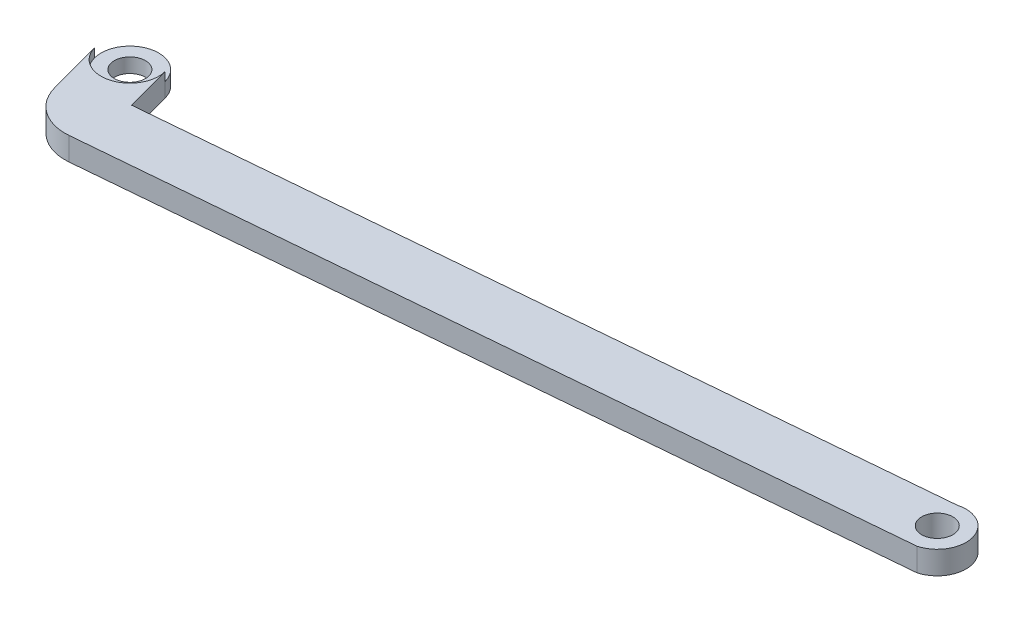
ISO-10303-21;
HEADER;
FILE_DESCRIPTION(('STEP AP214'),'2;1');
FILE_NAME('part.step','',(''),(''),'','','');
FILE_SCHEMA(('AUTOMOTIVE_DESIGN { 1 0 10303 214 1 1 1 1 }'));
ENDSEC;
DATA;
#1=APPLICATION_CONTEXT('core data for automotive mechanical design processes');
#2=APPLICATION_PROTOCOL_DEFINITION('international standard','automotive_design',2000,#1);
#3=PRODUCT_CONTEXT('',#1,'mechanical');
#4=PRODUCT('Part','Part','',(#3));
#5=PRODUCT_RELATED_PRODUCT_CATEGORY('part','',(#4));
#6=PRODUCT_DEFINITION_FORMATION('','',#4);
#7=PRODUCT_DEFINITION_CONTEXT('part definition',#1,'design');
#8=PRODUCT_DEFINITION('design','',#6,#7);
#9=PRODUCT_DEFINITION_SHAPE('','',#8);
#10=(LENGTH_UNIT() NAMED_UNIT(*) SI_UNIT(.MILLI.,.METRE.));
#11=(NAMED_UNIT(*) PLANE_ANGLE_UNIT() SI_UNIT($,.RADIAN.));
#12=(NAMED_UNIT(*) SI_UNIT($,.STERADIAN.) SOLID_ANGLE_UNIT());
#13=UNCERTAINTY_MEASURE_WITH_UNIT(LENGTH_MEASURE(1.E-05),#10,'distance_accuracy_value','');
#14=(GEOMETRIC_REPRESENTATION_CONTEXT(3) GLOBAL_UNCERTAINTY_ASSIGNED_CONTEXT((#13)) GLOBAL_UNIT_ASSIGNED_CONTEXT((#10,
#11,#12)) REPRESENTATION_CONTEXT('',''));
#15=CARTESIAN_POINT('',(0.,0.,0.));
#16=DIRECTION('',(0.,0.,1.));
#17=DIRECTION('',(1.,0.,0.));
#18=AXIS2_PLACEMENT_3D('',#15,#16,#17);
#19=CARTESIAN_POINT('',(-177.8,5.08,0.));
#20=DIRECTION('',(0.,-1.,0.));
#21=DIRECTION('',(0.,0.,-1.));
#22=AXIS2_PLACEMENT_3D('',#19,#20,#21);
#23=CYLINDRICAL_SURFACE('',#22,6.35);
#24=CARTESIAN_POINT('',(-177.8,3.175,0.));
#25=DIRECTION('',(0.,1.,0.));
#26=DIRECTION('',(0.,0.,1.));
#27=AXIS2_PLACEMENT_3D('',#24,#25,#26);
#28=CIRCLE('',#27,6.35);
#29=CARTESIAN_POINT('',(-171.666371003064,3.175,-1.64350093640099));
#30=VERTEX_POINT('',#29);
#31=CARTESIAN_POINT('',(-183.933628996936,3.175,1.64350093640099));
#32=VERTEX_POINT('',#31);
#33=EDGE_CURVE('E47',#30,#32,#28,.T.);
#34=ORIENTED_EDGE('',*,*,#33,.F.);
#35=DIRECTION('',(0.,-1.,0.));
#36=VECTOR('',#35,1.);
#37=CARTESIAN_POINT('',(-171.666371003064,5.08,-1.64350093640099));
#38=LINE('',#37,#36);
#39=CARTESIAN_POINT('',(-171.666371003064,0.,-1.64350093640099));
#40=VERTEX_POINT('',#39);
#41=EDGE_CURVE('E152',#30,#40,#38,.T.);
#42=ORIENTED_EDGE('',*,*,#41,.T.);
#43=CARTESIAN_POINT('',(-177.8,0.,0.));
#44=DIRECTION('',(0.,1.,0.));
#45=DIRECTION('',(0.,0.,1.));
#46=AXIS2_PLACEMENT_3D('',#43,#44,#45);
#47=CIRCLE('',#46,6.35);
#48=CARTESIAN_POINT('',(-183.933628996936,0.,1.64350093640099));
#49=VERTEX_POINT('',#48);
#50=EDGE_CURVE('E142',#40,#49,#47,.T.);
#51=ORIENTED_EDGE('',*,*,#50,.T.);
#52=DIRECTION('',(0.,-1.,0.));
#53=VECTOR('',#52,1.);
#54=CARTESIAN_POINT('',(-183.933628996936,5.08,1.64350093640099));
#55=LINE('',#54,#53);
#56=EDGE_CURVE('E148',#32,#49,#55,.T.);
#57=ORIENTED_EDGE('',*,*,#56,.F.);
#58=EDGE_LOOP('',(#34,#42,#51,#57));
#59=FACE_BOUND('',#58,.T.);
#60=ADVANCED_FACE('F32',(#59),#23,.T.);
#61=CARTESIAN_POINT('',(-177.8,5.08,0.));
#62=DIRECTION('',(0.,-1.,0.));
#63=DIRECTION('',(0.,0.,-1.));
#64=AXIS2_PLACEMENT_3D('',#61,#62,#63);
#65=CYLINDRICAL_SURFACE('',#64,3.429);
#66=CARTESIAN_POINT('',(-177.8,0.,0.));
#67=DIRECTION('',(0.,1.,0.));
#68=DIRECTION('',(0.,0.,1.));
#69=AXIS2_PLACEMENT_3D('',#66,#67,#68);
#70=CIRCLE('',#69,3.429);
#71=CARTESIAN_POINT('',(-177.8,0.,3.429));
#72=VERTEX_POINT('',#71);
#73=EDGE_CURVE('E181',#72,#72,#70,.T.);
#74=ORIENTED_EDGE('',*,*,#73,.F.);
#75=EDGE_LOOP('',(#74));
#76=FACE_BOUND('',#75,.T.);
#77=CARTESIAN_POINT('',(-177.8,3.175,0.));
#78=DIRECTION('',(0.,1.,0.));
#79=DIRECTION('',(0.,0.,1.));
#80=AXIS2_PLACEMENT_3D('',#77,#78,#79);
#81=CIRCLE('',#80,3.429);
#82=CARTESIAN_POINT('',(-177.8,3.175,3.429));
#83=VERTEX_POINT('',#82);
#84=EDGE_CURVE('E36',#83,#83,#81,.T.);
#85=ORIENTED_EDGE('',*,*,#84,.T.);
#86=EDGE_LOOP('',(#85));
#87=FACE_BOUND('',#86,.T.);
#88=ADVANCED_FACE('F202',(#76,#87),#65,.F.);
#89=CARTESIAN_POINT('',(-170.900005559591,5.08,11.0304202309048));
#90=DIRECTION('',(0.,-1.,0.));
#91=DIRECTION('',(0.,0.,-1.));
#92=AXIS2_PLACEMENT_3D('',#89,#90,#91);
#93=PLANE('',#92);
#94=DIRECTION('',(-0.258819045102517,0.,-0.965925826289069));
#95=VECTOR('',#94,1.);
#96=CARTESIAN_POINT('',(-171.666371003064,5.08,-1.64350093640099));
#97=LINE('',#96,#95);
#98=CARTESIAN_POINT('',(-168.947471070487,5.08,8.50357175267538));
#99=VERTEX_POINT('',#98);
#100=CARTESIAN_POINT('',(-171.666371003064,5.08,-1.64350093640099));
#101=VERTEX_POINT('',#100);
#102=EDGE_CURVE('E123',#99,#101,#97,.T.);
#103=ORIENTED_EDGE('',*,*,#102,.T.);
#104=CARTESIAN_POINT('',(-177.8,5.08,0.));
#105=DIRECTION('',(0.,1.,0.));
#106=DIRECTION('',(0.,0.,1.));
#107=AXIS2_PLACEMENT_3D('',#104,#105,#106);
#108=CIRCLE('',#107,6.35);
#109=CARTESIAN_POINT('',(-183.933628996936,5.08,1.64350093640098));
#110=VERTEX_POINT('',#109);
#111=EDGE_CURVE('E170',#110,#101,#108,.T.);
#112=ORIENTED_EDGE('',*,*,#111,.F.);
#113=DIRECTION('',(0.258819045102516,0.,0.965925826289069));
#114=VECTOR('',#113,1.);
#115=CARTESIAN_POINT('',(-183.933628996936,5.08,1.64350093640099));
#116=LINE('',#115,#114);
#117=CARTESIAN_POINT('',(-180.713811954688,5.08,13.6600217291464));
#118=VERTEX_POINT('',#117);
#119=EDGE_CURVE('E56',#110,#118,#116,.T.);
#120=ORIENTED_EDGE('',*,*,#119,.T.);
#121=CARTESIAN_POINT('',(-170.900005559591,5.08,11.0304202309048));
#122=DIRECTION('',(0.,1.,0.));
#123=DIRECTION('',(0.,0.,-1.));
#124=AXIS2_PLACEMENT_3D('',#121,#122,#123);
#125=CIRCLE('',#124,10.16);
#126=CARTESIAN_POINT('',(-170.014503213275,5.08,21.1517583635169));
#127=VERTEX_POINT('',#126);
#128=EDGE_CURVE('E146',#118,#127,#125,.T.);
#129=ORIENTED_EDGE('',*,*,#128,.T.);
#130=DIRECTION('',(0.996194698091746,0.,-0.0871557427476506));
#131=VECTOR('',#130,1.);
#132=CARTESIAN_POINT('',(1.64350093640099,5.08,6.13362899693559));
#133=LINE('',#132,#131);
#134=CARTESIAN_POINT('',(1.64350093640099,5.08,6.13362899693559));
#135=VERTEX_POINT('',#134);
#136=EDGE_CURVE('E94',#127,#135,#133,.T.);
#137=ORIENTED_EDGE('',*,*,#136,.T.);
#138=CARTESIAN_POINT('',(0.,5.08,0.));
#139=DIRECTION('',(0.,1.,0.));
#140=DIRECTION('',(0.,0.,1.));
#141=AXIS2_PLACEMENT_3D('',#138,#139,#140);
#142=CIRCLE('',#141,6.35);
#143=CARTESIAN_POINT('',(-1.64350093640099,5.08,-6.13362899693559));
#144=VERTEX_POINT('',#143);
#145=EDGE_CURVE('E100',#135,#144,#142,.T.);
#146=ORIENTED_EDGE('',*,*,#145,.T.);
#147=DIRECTION('',(-0.996194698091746,0.,0.0871557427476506));
#148=VECTOR('',#147,1.);
#149=CARTESIAN_POINT('',(-1.64350093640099,5.08,-6.13362899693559));
#150=LINE('',#149,#148);
#151=EDGE_CURVE('E106',#144,#99,#150,.T.);
#152=ORIENTED_EDGE('',*,*,#151,.T.);
#153=EDGE_LOOP('',(#103,#112,#120,#129,#137,#146,#152));
#154=FACE_BOUND('',#153,.T.);
#155=CARTESIAN_POINT('',(0.,5.08,0.));
#156=DIRECTION('',(0.,1.,0.));
#157=DIRECTION('',(0.,0.,1.));
#158=AXIS2_PLACEMENT_3D('',#155,#156,#157);
#159=CIRCLE('',#158,3.429);
#160=CARTESIAN_POINT('',(0.,5.08,3.429));
#161=VERTEX_POINT('',#160);
#162=EDGE_CURVE('E134',#161,#161,#159,.T.);
#163=ORIENTED_EDGE('',*,*,#162,.F.);
#164=EDGE_LOOP('',(#163));
#165=FACE_BOUND('',#164,.T.);
#166=ADVANCED_FACE('F103',(#154,#165),#93,.F.);
#167=CARTESIAN_POINT('',(-170.900005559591,0.,11.0304202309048));
#168=DIRECTION('',(0.,-1.,0.));
#169=DIRECTION('',(0.,0.,-1.));
#170=AXIS2_PLACEMENT_3D('',#167,#168,#169);
#171=PLANE('',#170);
#172=CARTESIAN_POINT('',(0.,0.,0.));
#173=DIRECTION('',(0.,1.,0.));
#174=DIRECTION('',(0.,0.,1.));
#175=AXIS2_PLACEMENT_3D('',#172,#173,#174);
#176=CIRCLE('',#175,3.429);
#177=CARTESIAN_POINT('',(0.,0.,3.429));
#178=VERTEX_POINT('',#177);
#179=EDGE_CURVE('E186',#178,#178,#176,.T.);
#180=ORIENTED_EDGE('',*,*,#179,.T.);
#181=EDGE_LOOP('',(#180));
#182=FACE_BOUND('',#181,.T.);
#183=CARTESIAN_POINT('',(-170.900005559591,0.,11.0304202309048));
#184=DIRECTION('',(0.,1.,0.));
#185=DIRECTION('',(0.,0.,-1.));
#186=AXIS2_PLACEMENT_3D('',#183,#184,#185);
#187=CIRCLE('',#186,10.16);
#188=CARTESIAN_POINT('',(-180.713811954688,0.,13.6600217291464));
#189=VERTEX_POINT('',#188);
#190=CARTESIAN_POINT('',(-170.014503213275,0.,21.1517583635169));
#191=VERTEX_POINT('',#190);
#192=EDGE_CURVE('E130',#189,#191,#187,.T.);
#193=ORIENTED_EDGE('',*,*,#192,.F.);
#194=DIRECTION('',(0.258819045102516,0.,0.965925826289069));
#195=VECTOR('',#194,1.);
#196=CARTESIAN_POINT('',(-183.933628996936,0.,1.64350093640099));
#197=LINE('',#196,#195);
#198=EDGE_CURVE('E86',#49,#189,#197,.T.);
#199=ORIENTED_EDGE('',*,*,#198,.F.);
#200=ORIENTED_EDGE('',*,*,#50,.F.);
#201=DIRECTION('',(-0.258819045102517,0.,-0.965925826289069));
#202=VECTOR('',#201,1.);
#203=CARTESIAN_POINT('',(-171.666371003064,0.,-1.64350093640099));
#204=LINE('',#203,#202);
#205=CARTESIAN_POINT('',(-168.947471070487,0.,8.50357175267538));
#206=VERTEX_POINT('',#205);
#207=EDGE_CURVE('E139',#206,#40,#204,.T.);
#208=ORIENTED_EDGE('',*,*,#207,.F.);
#209=DIRECTION('',(-0.996194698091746,0.,0.0871557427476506));
#210=VECTOR('',#209,1.);
#211=CARTESIAN_POINT('',(-1.64350093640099,0.,-6.13362899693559));
#212=LINE('',#211,#210);
#213=CARTESIAN_POINT('',(-1.64350093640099,0.,-6.13362899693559));
#214=VERTEX_POINT('',#213);
#215=EDGE_CURVE('E137',#214,#206,#212,.T.);
#216=ORIENTED_EDGE('',*,*,#215,.F.);
#217=CARTESIAN_POINT('',(0.,0.,0.));
#218=DIRECTION('',(0.,1.,0.));
#219=DIRECTION('',(0.,0.,1.));
#220=AXIS2_PLACEMENT_3D('',#217,#218,#219);
#221=CIRCLE('',#220,6.35);
#222=CARTESIAN_POINT('',(1.64350093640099,0.,6.13362899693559));
#223=VERTEX_POINT('',#222);
#224=EDGE_CURVE('E115',#223,#214,#221,.T.);
#225=ORIENTED_EDGE('',*,*,#224,.F.);
#226=DIRECTION('',(0.996194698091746,0.,-0.0871557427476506));
#227=VECTOR('',#226,1.);
#228=CARTESIAN_POINT('',(1.64350093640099,0.,6.13362899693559));
#229=LINE('',#228,#227);
#230=EDGE_CURVE('E133',#191,#223,#229,.T.);
#231=ORIENTED_EDGE('',*,*,#230,.F.);
#232=EDGE_LOOP('',(#193,#199,#200,#208,#216,#225,#231));
#233=FACE_BOUND('',#232,.T.);
#234=ORIENTED_EDGE('',*,*,#73,.T.);
#235=EDGE_LOOP('',(#234));
#236=FACE_BOUND('',#235,.T.);
#237=ADVANCED_FACE('F159',(#182,#233,#236),#171,.T.);
#238=CARTESIAN_POINT('',(-170.900005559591,5.08,11.0304202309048));
#239=DIRECTION('',(0.,-1.,0.));
#240=DIRECTION('',(0.,0.,-1.));
#241=AXIS2_PLACEMENT_3D('',#238,#239,#240);
#242=CYLINDRICAL_SURFACE('',#241,10.16);
#243=ORIENTED_EDGE('',*,*,#192,.T.);
#244=DIRECTION('',(0.,-1.,0.));
#245=VECTOR('',#244,1.);
#246=CARTESIAN_POINT('',(-170.014503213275,5.08,21.1517583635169));
#247=LINE('',#246,#245);
#248=EDGE_CURVE('E11',#127,#191,#247,.T.);
#249=ORIENTED_EDGE('',*,*,#248,.F.);
#250=ORIENTED_EDGE('',*,*,#128,.F.);
#251=DIRECTION('',(0.,-1.,0.));
#252=VECTOR('',#251,1.);
#253=CARTESIAN_POINT('',(-180.713811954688,5.08,13.6600217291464));
#254=LINE('',#253,#252);
#255=EDGE_CURVE('E129',#118,#189,#254,.T.);
#256=ORIENTED_EDGE('',*,*,#255,.T.);
#257=EDGE_LOOP('',(#243,#249,#250,#256));
#258=FACE_BOUND('',#257,.T.);
#259=ADVANCED_FACE('F34',(#258),#242,.T.);
#260=CARTESIAN_POINT('',(1.64350093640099,5.08,6.13362899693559));
#261=DIRECTION('',(-0.0871557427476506,0.,-0.996194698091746));
#262=DIRECTION('',(-0.996194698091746,0.,0.0871557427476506));
#263=AXIS2_PLACEMENT_3D('',#260,#261,#262);
#264=PLANE('',#263);
#265=ORIENTED_EDGE('',*,*,#230,.T.);
#266=DIRECTION('',(0.,-1.,0.));
#267=VECTOR('',#266,1.);
#268=CARTESIAN_POINT('',(1.64350093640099,5.08,6.13362899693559));
#269=LINE('',#268,#267);
#270=EDGE_CURVE('E41',#135,#223,#269,.T.);
#271=ORIENTED_EDGE('',*,*,#270,.F.);
#272=ORIENTED_EDGE('',*,*,#136,.F.);
#273=ORIENTED_EDGE('',*,*,#248,.T.);
#274=EDGE_LOOP('',(#265,#271,#272,#273));
#275=FACE_BOUND('',#274,.T.);
#276=ADVANCED_FACE('F194',(#275),#264,.F.);
#277=CARTESIAN_POINT('',(0.,5.08,0.));
#278=DIRECTION('',(0.,-1.,0.));
#279=DIRECTION('',(0.,0.,-1.));
#280=AXIS2_PLACEMENT_3D('',#277,#278,#279);
#281=CYLINDRICAL_SURFACE('',#280,6.35);
#282=ORIENTED_EDGE('',*,*,#224,.T.);
#283=DIRECTION('',(0.,-1.,0.));
#284=VECTOR('',#283,1.);
#285=CARTESIAN_POINT('',(-1.64350093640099,5.08,-6.13362899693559));
#286=LINE('',#285,#284);
#287=EDGE_CURVE('E112',#144,#214,#286,.T.);
#288=ORIENTED_EDGE('',*,*,#287,.F.);
#289=ORIENTED_EDGE('',*,*,#145,.F.);
#290=ORIENTED_EDGE('',*,*,#270,.T.);
#291=EDGE_LOOP('',(#282,#288,#289,#290));
#292=FACE_BOUND('',#291,.T.);
#293=ADVANCED_FACE('F113',(#292),#281,.T.);
#294=CARTESIAN_POINT('',(-1.64350093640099,5.08,-6.13362899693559));
#295=DIRECTION('',(0.0871557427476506,0.,0.996194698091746));
#296=DIRECTION('',(0.996194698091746,0.,-0.0871557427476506));
#297=AXIS2_PLACEMENT_3D('',#294,#295,#296);
#298=PLANE('',#297);
#299=ORIENTED_EDGE('',*,*,#215,.T.);
#300=DIRECTION('',(0.,-1.,0.));
#301=VECTOR('',#300,1.);
#302=CARTESIAN_POINT('',(-168.947471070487,5.08,8.50357175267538));
#303=LINE('',#302,#301);
#304=EDGE_CURVE('E118',#99,#206,#303,.T.);
#305=ORIENTED_EDGE('',*,*,#304,.F.);
#306=ORIENTED_EDGE('',*,*,#151,.F.);
#307=ORIENTED_EDGE('',*,*,#287,.T.);
#308=EDGE_LOOP('',(#299,#305,#306,#307));
#309=FACE_BOUND('',#308,.T.);
#310=ADVANCED_FACE('F120',(#309),#298,.F.);
#311=CARTESIAN_POINT('',(-171.666371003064,5.08,-1.64350093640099));
#312=DIRECTION('',(-0.965925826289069,0.,0.258819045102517));
#313=DIRECTION('',(0.258819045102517,0.,0.965925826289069));
#314=AXIS2_PLACEMENT_3D('',#311,#312,#313);
#315=PLANE('',#314);
#316=ORIENTED_EDGE('',*,*,#207,.T.);
#317=ORIENTED_EDGE('',*,*,#41,.F.);
#318=EDGE_CURVE('E153',#101,#30,#38,.T.);
#319=ORIENTED_EDGE('',*,*,#318,.F.);
#320=ORIENTED_EDGE('',*,*,#102,.F.);
#321=ORIENTED_EDGE('',*,*,#304,.T.);
#322=EDGE_LOOP('',(#316,#317,#319,#320,#321));
#323=FACE_BOUND('',#322,.T.);
#324=ADVANCED_FACE('F164',(#323),#315,.F.);
#325=CARTESIAN_POINT('',(-183.933628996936,5.08,1.64350093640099));
#326=DIRECTION('',(0.96592582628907,0.,-0.258819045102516));
#327=DIRECTION('',(-0.258819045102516,0.,-0.965925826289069));
#328=AXIS2_PLACEMENT_3D('',#325,#326,#327);
#329=PLANE('',#328);
#330=ORIENTED_EDGE('',*,*,#198,.T.);
#331=ORIENTED_EDGE('',*,*,#255,.F.);
#332=ORIENTED_EDGE('',*,*,#119,.F.);
#333=EDGE_CURVE('E149',#110,#32,#55,.T.);
#334=ORIENTED_EDGE('',*,*,#333,.T.);
#335=ORIENTED_EDGE('',*,*,#56,.T.);
#336=EDGE_LOOP('',(#330,#331,#332,#334,#335));
#337=FACE_BOUND('',#336,.T.);
#338=ADVANCED_FACE('F211',(#337),#329,.F.);
#339=CARTESIAN_POINT('',(0.,5.08,0.));
#340=DIRECTION('',(0.,-1.,0.));
#341=DIRECTION('',(0.,0.,-1.));
#342=AXIS2_PLACEMENT_3D('',#339,#340,#341);
#343=CYLINDRICAL_SURFACE('',#342,3.429);
#344=ORIENTED_EDGE('',*,*,#162,.T.);
#345=EDGE_LOOP('',(#344));
#346=FACE_BOUND('',#345,.T.);
#347=ORIENTED_EDGE('',*,*,#179,.F.);
#348=EDGE_LOOP('',(#347));
#349=FACE_BOUND('',#348,.T.);
#350=ADVANCED_FACE('F232',(#346,#349),#343,.F.);
#351=CARTESIAN_POINT('',(-177.8,3.175,0.));
#352=DIRECTION('',(0.,1.,0.));
#353=DIRECTION('',(0.,0.,1.));
#354=AXIS2_PLACEMENT_3D('',#351,#352,#353);
#355=CYLINDRICAL_SURFACE('',#354,6.35);
#356=EDGE_CURVE('E175',#32,#30,#28,.T.);
#357=ORIENTED_EDGE('',*,*,#356,.F.);
#358=ORIENTED_EDGE('',*,*,#333,.F.);
#359=ORIENTED_EDGE('',*,*,#111,.T.);
#360=ORIENTED_EDGE('',*,*,#318,.T.);
#361=EDGE_LOOP('',(#357,#358,#359,#360));
#362=FACE_BOUND('',#361,.T.);
#363=ADVANCED_FACE('F174',(#362),#355,.F.);
#364=CARTESIAN_POINT('',(-177.8,3.175,0.));
#365=DIRECTION('',(0.,1.,0.));
#366=DIRECTION('',(0.,0.,1.));
#367=AXIS2_PLACEMENT_3D('',#364,#365,#366);
#368=PLANE('',#367);
#369=ORIENTED_EDGE('',*,*,#84,.F.);
#370=EDGE_LOOP('',(#369));
#371=FACE_BOUND('',#370,.T.);
#372=ORIENTED_EDGE('',*,*,#33,.T.);
#373=ORIENTED_EDGE('',*,*,#356,.T.);
#374=EDGE_LOOP('',(#372,#373));
#375=FACE_BOUND('',#374,.T.);
#376=ADVANCED_FACE('F177',(#371,#375),#368,.T.);
#377=CLOSED_SHELL('',(#60,#88,#166,#237,#259,#276,#293,#310,#324,#338,#350,#363,#376));
#378=MANIFOLD_SOLID_BREP('B2',#377);
#379=ADVANCED_BREP_SHAPE_REPRESENTATION('',(#18,#378),#14);
#380=SHAPE_DEFINITION_REPRESENTATION(#9,#379);
ENDSEC;
END-ISO-10303-21;
